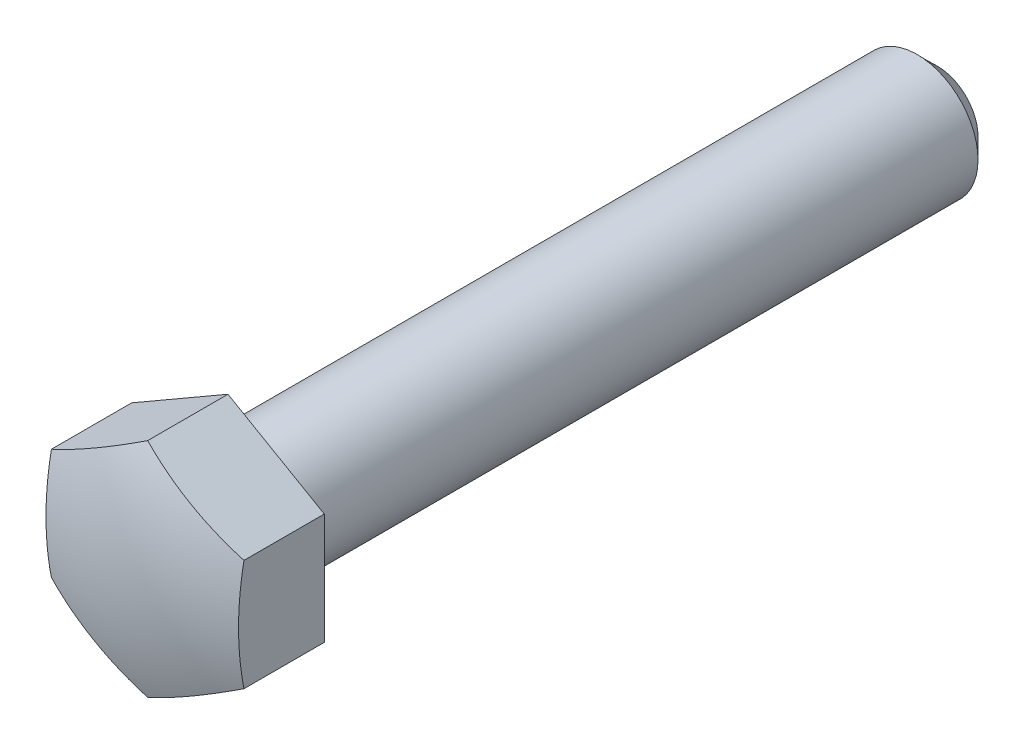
ISO-10303-21;
HEADER;
FILE_DESCRIPTION(('STEP AP214'),'2;1');
FILE_NAME('part.step','',(''),(''),'','','');
FILE_SCHEMA(('AUTOMOTIVE_DESIGN { 1 0 10303 214 1 1 1 1 }'));
ENDSEC;
DATA;
#1=APPLICATION_CONTEXT('core data for automotive mechanical design processes');
#2=APPLICATION_PROTOCOL_DEFINITION('international standard','automotive_design',2000,#1);
#3=PRODUCT_CONTEXT('',#1,'mechanical');
#4=PRODUCT('Part','Part','',(#3));
#5=PRODUCT_RELATED_PRODUCT_CATEGORY('part','',(#4));
#6=PRODUCT_DEFINITION_FORMATION('','',#4);
#7=PRODUCT_DEFINITION_CONTEXT('part definition',#1,'design');
#8=PRODUCT_DEFINITION('design','',#6,#7);
#9=PRODUCT_DEFINITION_SHAPE('','',#8);
#10=(LENGTH_UNIT() NAMED_UNIT(*) SI_UNIT(.MILLI.,.METRE.));
#11=(NAMED_UNIT(*) PLANE_ANGLE_UNIT() SI_UNIT($,.RADIAN.));
#12=(NAMED_UNIT(*) SI_UNIT($,.STERADIAN.) SOLID_ANGLE_UNIT());
#13=UNCERTAINTY_MEASURE_WITH_UNIT(LENGTH_MEASURE(1.E-05),#10,'distance_accuracy_value','');
#14=(GEOMETRIC_REPRESENTATION_CONTEXT(3) GLOBAL_UNCERTAINTY_ASSIGNED_CONTEXT((#13)) GLOBAL_UNIT_ASSIGNED_CONTEXT((#10,
#11,#12)) REPRESENTATION_CONTEXT('',''));
#15=CARTESIAN_POINT('',(0.,0.,0.));
#16=DIRECTION('',(0.,0.,1.));
#17=DIRECTION('',(1.,0.,0.));
#18=AXIS2_PLACEMENT_3D('',#15,#16,#17);
#19=CARTESIAN_POINT('',(6.,0.,0.));
#20=DIRECTION('',(0.,0.,1.));
#21=DIRECTION('',(1.,0.,0.));
#22=AXIS2_PLACEMENT_3D('',#19,#20,#21);
#23=PLANE('',#22);
#24=CARTESIAN_POINT('',(0.,0.,0.));
#25=DIRECTION('',(0.,0.,1.));
#26=DIRECTION('',(1.,0.,0.));
#27=AXIS2_PLACEMENT_3D('',#24,#25,#26);
#28=CIRCLE('',#27,6.);
#29=CARTESIAN_POINT('',(6.,0.,0.));
#30=VERTEX_POINT('',#29);
#31=EDGE_CURVE('E110',#30,#30,#28,.T.);
#32=ORIENTED_EDGE('',*,*,#31,.T.);
#33=EDGE_LOOP('',(#32));
#34=FACE_BOUND('',#33,.T.);
#35=DIRECTION('',(-0.86602540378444,-0.5,0.));
#36=VECTOR('',#35,1.);
#37=CARTESIAN_POINT('',(9.5,-5.48482755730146,0.));
#38=LINE('',#37,#36);
#39=CARTESIAN_POINT('',(9.5,-5.48482755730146,0.));
#40=VERTEX_POINT('',#39);
#41=CARTESIAN_POINT('',(0.,-10.9696551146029,0.));
#42=VERTEX_POINT('',#41);
#43=EDGE_CURVE('E107',#40,#42,#38,.T.);
#44=ORIENTED_EDGE('',*,*,#43,.T.);
#45=DIRECTION('',(0.86602540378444,-0.5,0.));
#46=VECTOR('',#45,1.);
#47=CARTESIAN_POINT('',(-9.5,-5.48482755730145,0.));
#48=LINE('',#47,#46);
#49=CARTESIAN_POINT('',(-9.5,-5.48482755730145,0.));
#50=VERTEX_POINT('',#49);
#51=EDGE_CURVE('E85',#50,#42,#48,.T.);
#52=ORIENTED_EDGE('',*,*,#51,.F.);
#53=DIRECTION('',(0.,-1.,0.));
#54=VECTOR('',#53,1.);
#55=CARTESIAN_POINT('',(-9.5,5.48482755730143,0.));
#56=LINE('',#55,#54);
#57=CARTESIAN_POINT('',(-9.5,5.48482755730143,0.));
#58=VERTEX_POINT('',#57);
#59=EDGE_CURVE('E62',#58,#50,#56,.T.);
#60=ORIENTED_EDGE('',*,*,#59,.F.);
#61=DIRECTION('',(0.866025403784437,0.5,0.));
#62=VECTOR('',#61,1.);
#63=CARTESIAN_POINT('',(-9.5,5.48482755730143,0.));
#64=LINE('',#63,#62);
#65=CARTESIAN_POINT('',(0.,10.9696551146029,0.));
#66=VERTEX_POINT('',#65);
#67=EDGE_CURVE('E109',#58,#66,#64,.T.);
#68=ORIENTED_EDGE('',*,*,#67,.T.);
#69=DIRECTION('',(-0.866025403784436,0.5,0.));
#70=VECTOR('',#69,1.);
#71=CARTESIAN_POINT('',(9.5,5.48482755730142,0.));
#72=LINE('',#71,#70);
#73=CARTESIAN_POINT('',(9.5,5.48482755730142,0.));
#74=VERTEX_POINT('',#73);
#75=EDGE_CURVE('E100',#74,#66,#72,.T.);
#76=ORIENTED_EDGE('',*,*,#75,.F.);
#77=DIRECTION('',(0.,-1.,0.));
#78=VECTOR('',#77,1.);
#79=CARTESIAN_POINT('',(9.5,5.48482755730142,0.));
#80=LINE('',#79,#78);
#81=EDGE_CURVE('E82',#74,#40,#80,.T.);
#82=ORIENTED_EDGE('',*,*,#81,.T.);
#83=EDGE_LOOP('',(#44,#52,#60,#68,#76,#82));
#84=FACE_BOUND('',#83,.T.);
#85=ADVANCED_FACE('F14',(#34,#84),#23,.F.);
#86=CARTESIAN_POINT('',(0.,0.,-10.));
#87=DIRECTION('',(0.,0.,1.));
#88=DIRECTION('',(1.,0.,0.));
#89=AXIS2_PLACEMENT_3D('',#86,#87,#88);
#90=CYLINDRICAL_SURFACE('',#89,6.);
#91=CARTESIAN_POINT('',(0.,0.,-68.));
#92=DIRECTION('',(0.,0.,1.));
#93=DIRECTION('',(1.,0.,0.));
#94=AXIS2_PLACEMENT_3D('',#91,#92,#93);
#95=CIRCLE('',#94,6.);
#96=CARTESIAN_POINT('',(6.,0.,-68.));
#97=VERTEX_POINT('',#96);
#98=EDGE_CURVE('E23',#97,#97,#95,.T.);
#99=ORIENTED_EDGE('',*,*,#98,.T.);
#100=EDGE_LOOP('',(#99));
#101=FACE_BOUND('',#100,.T.);
#102=ORIENTED_EDGE('',*,*,#31,.F.);
#103=EDGE_LOOP('',(#102));
#104=FACE_BOUND('',#103,.T.);
#105=ADVANCED_FACE('F146',(#101,#104),#90,.T.);
#106=CARTESIAN_POINT('',(0.,0.,-70.));
#107=DIRECTION('',(0.,0.,1.));
#108=DIRECTION('',(1.,0.,0.));
#109=AXIS2_PLACEMENT_3D('',#106,#107,#108);
#110=PLANE('',#109);
#111=CARTESIAN_POINT('',(0.,0.,-70.));
#112=DIRECTION('',(0.,0.,1.));
#113=DIRECTION('',(1.,0.,0.));
#114=AXIS2_PLACEMENT_3D('',#111,#112,#113);
#115=CIRCLE('',#114,4.);
#116=CARTESIAN_POINT('',(4.,0.,-70.));
#117=VERTEX_POINT('',#116);
#118=EDGE_CURVE('E9',#117,#117,#115,.F.);
#119=ORIENTED_EDGE('',*,*,#118,.T.);
#120=EDGE_LOOP('',(#119));
#121=FACE_BOUND('',#120,.T.);
#122=ADVANCED_FACE('F152',(#121),#110,.F.);
#123=CARTESIAN_POINT('',(-9.5,-5.48482755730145,10.));
#124=DIRECTION('',(0.5,0.86602540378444,0.));
#125=DIRECTION('',(-0.86602540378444,0.5,0.));
#126=AXIS2_PLACEMENT_3D('',#123,#124,#125);
#127=PLANE('',#126);
#128=CARTESIAN_POINT('',(-4.75,-8.22724133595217,-20.));
#129=DIRECTION('',(0.5,0.86602540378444,0.));
#130=DIRECTION('',(-0.86602540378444,0.5,0.));
#131=AXIS2_PLACEMENT_3D('',#128,#129,#130);
#132=CIRCLE('',#131,28.4561065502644);
#133=CARTESIAN_POINT('',(0.,-10.9696551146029,7.92251182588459));
#134=VERTEX_POINT('',#133);
#135=CARTESIAN_POINT('',(-9.5,-5.48482755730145,7.92251182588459));
#136=VERTEX_POINT('',#135);
#137=EDGE_CURVE('E76',#134,#136,#132,.F.);
#138=ORIENTED_EDGE('',*,*,#137,.T.);
#139=DIRECTION('',(0.,0.,-1.));
#140=VECTOR('',#139,1.);
#141=CARTESIAN_POINT('',(-9.5,-5.48482755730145,10.));
#142=LINE('',#141,#140);
#143=EDGE_CURVE('E78',#136,#50,#142,.T.);
#144=ORIENTED_EDGE('',*,*,#143,.T.);
#145=ORIENTED_EDGE('',*,*,#51,.T.);
#146=DIRECTION('',(0.,0.,-1.));
#147=VECTOR('',#146,1.);
#148=CARTESIAN_POINT('',(0.,-10.9696551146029,10.));
#149=LINE('',#148,#147);
#150=EDGE_CURVE('E31',#134,#42,#149,.T.);
#151=ORIENTED_EDGE('',*,*,#150,.F.);
#152=EDGE_LOOP('',(#138,#144,#145,#151));
#153=FACE_BOUND('',#152,.T.);
#154=ADVANCED_FACE('F77',(#153),#127,.F.);
#155=CARTESIAN_POINT('',(-9.5,5.48482755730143,10.));
#156=DIRECTION('',(1.,0.,0.));
#157=DIRECTION('',(0.,1.,0.));
#158=AXIS2_PLACEMENT_3D('',#155,#156,#157);
#159=PLANE('',#158);
#160=CARTESIAN_POINT('',(-9.5,0.,-20.));
#161=DIRECTION('',(1.,0.,0.));
#162=DIRECTION('',(0.,1.,0.));
#163=AXIS2_PLACEMENT_3D('',#160,#161,#162);
#164=CIRCLE('',#163,28.4561065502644);
#165=CARTESIAN_POINT('',(-9.5,5.48482755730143,7.92251182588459));
#166=VERTEX_POINT('',#165);
#167=EDGE_CURVE('E71',#136,#166,#164,.F.);
#168=ORIENTED_EDGE('',*,*,#167,.T.);
#169=DIRECTION('',(0.,0.,-1.));
#170=VECTOR('',#169,1.);
#171=CARTESIAN_POINT('',(-9.5,5.48482755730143,10.));
#172=LINE('',#171,#170);
#173=EDGE_CURVE('E91',#166,#58,#172,.T.);
#174=ORIENTED_EDGE('',*,*,#173,.T.);
#175=ORIENTED_EDGE('',*,*,#59,.T.);
#176=ORIENTED_EDGE('',*,*,#143,.F.);
#177=EDGE_LOOP('',(#168,#174,#175,#176));
#178=FACE_BOUND('',#177,.T.);
#179=ADVANCED_FACE('F84',(#178),#159,.F.);
#180=CARTESIAN_POINT('',(-9.5,5.48482755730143,10.));
#181=DIRECTION('',(-0.5,0.866025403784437,0.));
#182=DIRECTION('',(-0.866025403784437,-0.5,0.));
#183=AXIS2_PLACEMENT_3D('',#180,#181,#182);
#184=PLANE('',#183);
#185=DIRECTION('',(0.,0.,-1.));
#186=VECTOR('',#185,1.);
#187=CARTESIAN_POINT('',(0.,10.9696551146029,10.));
#188=LINE('',#187,#186);
#189=CARTESIAN_POINT('',(0.,10.9696551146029,7.92251182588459));
#190=VERTEX_POINT('',#189);
#191=EDGE_CURVE('E53',#190,#66,#188,.T.);
#192=ORIENTED_EDGE('',*,*,#191,.T.);
#193=ORIENTED_EDGE('',*,*,#67,.F.);
#194=ORIENTED_EDGE('',*,*,#173,.F.);
#195=CARTESIAN_POINT('',(-4.75,8.22724133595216,-20.));
#196=DIRECTION('',(-0.5,0.866025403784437,0.));
#197=DIRECTION('',(-0.866025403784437,-0.5,0.));
#198=AXIS2_PLACEMENT_3D('',#195,#196,#197);
#199=CIRCLE('',#198,28.4561065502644);
#200=EDGE_CURVE('E90',#190,#166,#199,.F.);
#201=ORIENTED_EDGE('',*,*,#200,.F.);
#202=EDGE_LOOP('',(#192,#193,#194,#201));
#203=FACE_BOUND('',#202,.T.);
#204=ADVANCED_FACE('F134',(#203),#184,.T.);
#205=CARTESIAN_POINT('',(9.5,5.48482755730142,10.));
#206=DIRECTION('',(-0.5,-0.866025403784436,0.));
#207=DIRECTION('',(0.866025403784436,-0.5,0.));
#208=AXIS2_PLACEMENT_3D('',#205,#206,#207);
#209=PLANE('',#208);
#210=CARTESIAN_POINT('',(4.75,8.22724133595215,-20.));
#211=DIRECTION('',(-0.5,-0.866025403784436,0.));
#212=DIRECTION('',(0.866025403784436,-0.5,0.));
#213=AXIS2_PLACEMENT_3D('',#210,#211,#212);
#214=CIRCLE('',#213,28.4561065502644);
#215=CARTESIAN_POINT('',(9.5,5.48482755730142,7.92251182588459));
#216=VERTEX_POINT('',#215);
#217=EDGE_CURVE('E103',#190,#216,#214,.F.);
#218=ORIENTED_EDGE('',*,*,#217,.T.);
#219=DIRECTION('',(0.,0.,-1.));
#220=VECTOR('',#219,1.);
#221=CARTESIAN_POINT('',(9.5,5.48482755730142,10.));
#222=LINE('',#221,#220);
#223=EDGE_CURVE('E101',#216,#74,#222,.T.);
#224=ORIENTED_EDGE('',*,*,#223,.T.);
#225=ORIENTED_EDGE('',*,*,#75,.T.);
#226=ORIENTED_EDGE('',*,*,#191,.F.);
#227=EDGE_LOOP('',(#218,#224,#225,#226));
#228=FACE_BOUND('',#227,.T.);
#229=ADVANCED_FACE('F127',(#228),#209,.F.);
#230=CARTESIAN_POINT('',(9.5,5.48482755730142,10.));
#231=DIRECTION('',(1.,0.,0.));
#232=DIRECTION('',(0.,1.,0.));
#233=AXIS2_PLACEMENT_3D('',#230,#231,#232);
#234=PLANE('',#233);
#235=DIRECTION('',(0.,0.,-1.));
#236=VECTOR('',#235,1.);
#237=CARTESIAN_POINT('',(9.5,-5.48482755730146,10.));
#238=LINE('',#237,#236);
#239=CARTESIAN_POINT('',(9.5,-5.48482755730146,7.92251182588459));
#240=VERTEX_POINT('',#239);
#241=EDGE_CURVE('E98',#240,#40,#238,.T.);
#242=ORIENTED_EDGE('',*,*,#241,.T.);
#243=ORIENTED_EDGE('',*,*,#81,.F.);
#244=ORIENTED_EDGE('',*,*,#223,.F.);
#245=CARTESIAN_POINT('',(9.5,0.,-20.));
#246=DIRECTION('',(1.,0.,0.));
#247=DIRECTION('',(0.,1.,0.));
#248=AXIS2_PLACEMENT_3D('',#245,#246,#247);
#249=CIRCLE('',#248,28.4561065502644);
#250=EDGE_CURVE('E120',#240,#216,#249,.F.);
#251=ORIENTED_EDGE('',*,*,#250,.F.);
#252=EDGE_LOOP('',(#242,#243,#244,#251));
#253=FACE_BOUND('',#252,.T.);
#254=ADVANCED_FACE('F130',(#253),#234,.T.);
#255=CARTESIAN_POINT('',(9.5,-5.48482755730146,10.));
#256=DIRECTION('',(0.5,-0.86602540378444,0.));
#257=DIRECTION('',(0.86602540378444,0.5,0.));
#258=AXIS2_PLACEMENT_3D('',#255,#256,#257);
#259=PLANE('',#258);
#260=ORIENTED_EDGE('',*,*,#150,.T.);
#261=ORIENTED_EDGE('',*,*,#43,.F.);
#262=ORIENTED_EDGE('',*,*,#241,.F.);
#263=CARTESIAN_POINT('',(4.75,-8.22724133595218,-20.));
#264=DIRECTION('',(0.5,-0.86602540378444,0.));
#265=DIRECTION('',(0.86602540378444,0.5,0.));
#266=AXIS2_PLACEMENT_3D('',#263,#264,#265);
#267=CIRCLE('',#266,28.4561065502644);
#268=EDGE_CURVE('E106',#134,#240,#267,.F.);
#269=ORIENTED_EDGE('',*,*,#268,.F.);
#270=EDGE_LOOP('',(#260,#261,#262,#269));
#271=FACE_BOUND('',#270,.T.);
#272=ADVANCED_FACE('F158',(#271),#259,.T.);
#273=CARTESIAN_POINT('',(0.,0.,-20.));
#274=DIRECTION('',(0.,0.,1.));
#275=DIRECTION('',(1.,0.,0.));
#276=AXIS2_PLACEMENT_3D('',#273,#274,#275);
#277=SPHERICAL_SURFACE('',#276,30.);
#278=ORIENTED_EDGE('',*,*,#137,.F.);
#279=ORIENTED_EDGE('',*,*,#268,.T.);
#280=ORIENTED_EDGE('',*,*,#250,.T.);
#281=ORIENTED_EDGE('',*,*,#217,.F.);
#282=ORIENTED_EDGE('',*,*,#200,.T.);
#283=ORIENTED_EDGE('',*,*,#167,.F.);
#284=EDGE_LOOP('',(#278,#279,#280,#281,#282,#283));
#285=FACE_BOUND('',#284,.T.);
#286=ADVANCED_FACE('F88',(#285),#277,.T.);
#287=CARTESIAN_POINT('',(0.,0.,-68.));
#288=DIRECTION('',(0.,0.,1.));
#289=DIRECTION('',(1.,0.,0.));
#290=AXIS2_PLACEMENT_3D('',#287,#288,#289);
#291=CONICAL_SURFACE('',#290,6.,0.785398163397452);
#292=ORIENTED_EDGE('',*,*,#118,.F.);
#293=EDGE_LOOP('',(#292));
#294=FACE_BOUND('',#293,.T.);
#295=ORIENTED_EDGE('',*,*,#98,.F.);
#296=EDGE_LOOP('',(#295));
#297=FACE_BOUND('',#296,.T.);
#298=ADVANCED_FACE('F16',(#294,#297),#291,.T.);
#299=CLOSED_SHELL('',(#85,#105,#122,#154,#179,#204,#229,#254,#272,#286,#298));
#300=MANIFOLD_SOLID_BREP('B1',#299);
#301=ADVANCED_BREP_SHAPE_REPRESENTATION('',(#18,#300),#14);
#302=SHAPE_DEFINITION_REPRESENTATION(#9,#301);
ENDSEC;
END-ISO-10303-21;
